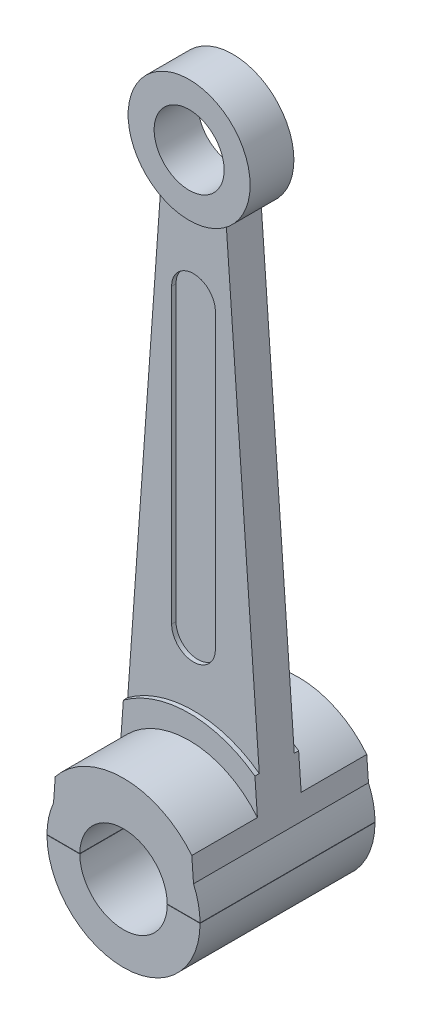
from build123d import *

# Parameters (mm, degrees)
SKETCH_1_R           = 1.395
SKETCH_1_R_2         = 0.8
EXTRUDE_1_DEPTH      = 0.5
SKETCH_1_R_3         = 2.538
SKETCH_1_R_4         = 1
EXTRUDE_1_2_DEPTH    = 0.5
EXTRUDE_2_DEPTH      = 0.4
EXTRUDE_3_DEPTH      = 0.3
EXTRUDE_4_DEPTH      = 1.5
EXTRUDE_4_DEPTH_BACK = 2.5
SKETCH_2_R           = 2
SKETCH_2_R_2         = 1
CUT_EXTRUDE_1_DEPTH  = 15.75
SKETCH_4_W           = 13.150123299
SKETCH_4_H           = 0.008
CUT_EXTRUDE_2_DEPTH  = 15.75


with BuildPart() as part:
    # Sketch 1 → Extrude 1 (new, symmetric)
    with BuildSketch(Plane.XY):
        with Locations((0, 13.69)):
            Circle(SKETCH_1_R)
        with Locations((0, 13.69)):
            Circle(SKETCH_1_R_2, mode=Mode.SUBTRACT)
    extrude(amount=EXTRUDE_1_DEPTH, both=True)



with BuildPart() as body_2:
    # Sketch 1 → Extrude 1 2 (new, symmetric)
    with BuildSketch(Plane.XY):
        Circle(SKETCH_1_R_3)
        Circle(SKETCH_1_R_4, mode=Mode.SUBTRACT)
    extrude(amount=EXTRUDE_1_2_DEPTH, both=True)


with BuildPart() as part_1:
    add(part.part)

    add(body_2.part)  # Extrude 2 merges body 2
    # Sketch 1_3 → Extrude 2 (add, symmetric)
    with BuildSketch(Plane.XY):
        with BuildLine():
            ThreePointArc((0.75, 12.513766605), (0, 12.295), (-0.75, 12.513766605))
            Line((-0.75, 12.513766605), (-1.65, 1.928456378))
            ThreePointArc((-1.65, 1.928456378), (0, 2.538), (1.65, 1.928456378))
            Line((1.65, 1.928456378), (0.75, 12.513766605))
        make_face()
        with BuildLine():
            ThreePointArc((-0.5, 10.69), (0, 11.19), (0.5, 10.69))
            Line((0.5, 10.69), (0.5, 4))
            ThreePointArc((0.5, 4), (0, 3.5), (-0.5, 4))
            Line((-0.5, 4), (-0.5, 10.69))
        make_face(mode=Mode.SUBTRACT)
    extrude(amount=EXTRUDE_2_DEPTH, both=True)

    # Sketch 1_4 → Extrude 3 (add, symmetric)
    with BuildSketch(Plane.XY):
        with BuildLine():
            Line((-0.5, 10.69), (-0.5, 4))
            ThreePointArc((-0.5, 4), (0, 3.5), (0.5, 4))
            Line((0.5, 4), (0.5, 10.69))
            ThreePointArc((0.5, 10.69), (0, 11.19), (-0.5, 10.69))
        make_face()
    extrude(amount=EXTRUDE_3_DEPTH, both=True)

    # Sketch 2 → Extrude 4 (add, two sides: drawn at the far end of the back side and taken through both)
    with BuildSketch(Plane.XY.offset(0.5).offset(-EXTRUDE_4_DEPTH_BACK)):
        Circle(SKETCH_2_R)
        Circle(SKETCH_2_R_2, mode=Mode.SUBTRACT)
    extrude(amount=EXTRUDE_4_DEPTH + EXTRUDE_4_DEPTH_BACK)

    # Sketch 3 → Cut-Extrude 1 (cut, symmetric)
    with BuildSketch(Plane.XY):
        with BuildLine():
            Line((-0.75, 12.513766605), (-2.776329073, 2.131196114))
            ThreePointArc((-2.776329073, 2.131196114), (0, -3.5), (2.776329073, 2.131196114))
            Line((2.776329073, 2.131196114), (0.75, 12.513766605))
            Line((0.75, 12.513766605), (1.6, 0.708872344))
            ThreePointArc((1.6, 0.708872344), (0, -1.75), (-1.6, 0.708872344))
            Line((-1.6, 0.708872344), (-0.75, 12.513766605))
        make_face()
    extrude(amount=CUT_EXTRUDE_1_DEPTH, both=True, mode=Mode.SUBTRACT)

    # Sketch 4 → Cut-Extrude 2 (cut, symmetric)
    with BuildSketch(Plane.XY):
        with Locations((0.112531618, 0.004)):
            Rectangle(SKETCH_4_W, SKETCH_4_H)
    extrude(amount=CUT_EXTRUDE_2_DEPTH, both=True, mode=Mode.SUBTRACT)


with BuildPart() as cut_extrude_2_piece_1:
    # of the separate pieces the step leaves, piece 1, a body of its own (cut_extrude_2_pieces)
    add(part_1.part.solids().sort_by_distance((1.50383015, 2.044489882, -0.5))[0])


with BuildPart() as cut_extrude_2_piece_2:
    # of the separate pieces the step leaves, piece 2, a body of its own (cut_extrude_2_pieces)
    add(part_1.part.solids().sort_by_distance((-1.75, 0, -2))[0])


solid = Compound([cut_extrude_2_piece_1.part, cut_extrude_2_piece_2.part])
